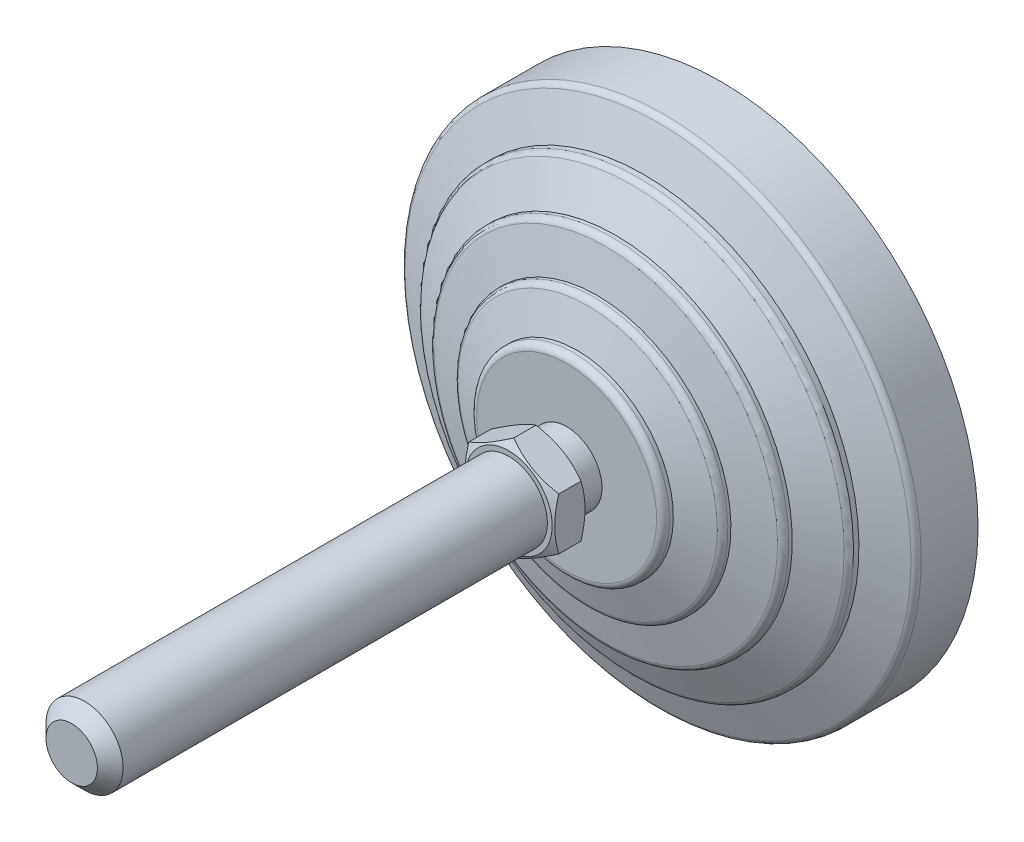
ISO-10303-21;
HEADER;
FILE_DESCRIPTION(('STEP AP214'),'2;1');
FILE_NAME('part.step','',(''),(''),'','','');
FILE_SCHEMA(('AUTOMOTIVE_DESIGN { 1 0 10303 214 1 1 1 1 }'));
ENDSEC;
DATA;
#1=APPLICATION_CONTEXT('core data for automotive mechanical design processes');
#2=APPLICATION_PROTOCOL_DEFINITION('international standard','automotive_design',2000,#1);
#3=PRODUCT_CONTEXT('',#1,'mechanical');
#4=PRODUCT('Part','Part','',(#3));
#5=PRODUCT_RELATED_PRODUCT_CATEGORY('part','',(#4));
#6=PRODUCT_DEFINITION_FORMATION('','',#4);
#7=PRODUCT_DEFINITION_CONTEXT('part definition',#1,'design');
#8=PRODUCT_DEFINITION('design','',#6,#7);
#9=PRODUCT_DEFINITION_SHAPE('','',#8);
#10=(LENGTH_UNIT() NAMED_UNIT(*) SI_UNIT(.MILLI.,.METRE.));
#11=(NAMED_UNIT(*) PLANE_ANGLE_UNIT() SI_UNIT($,.RADIAN.));
#12=(NAMED_UNIT(*) SI_UNIT($,.STERADIAN.) SOLID_ANGLE_UNIT());
#13=UNCERTAINTY_MEASURE_WITH_UNIT(LENGTH_MEASURE(1.E-05),#10,'distance_accuracy_value','');
#14=(GEOMETRIC_REPRESENTATION_CONTEXT(3) GLOBAL_UNCERTAINTY_ASSIGNED_CONTEXT((#13)) GLOBAL_UNIT_ASSIGNED_CONTEXT((#10,
#11,#12)) REPRESENTATION_CONTEXT('',''));
#15=CARTESIAN_POINT('',(0.,0.,0.));
#16=DIRECTION('',(0.,0.,1.));
#17=DIRECTION('',(1.,0.,0.));
#18=AXIS2_PLACEMENT_3D('',#15,#16,#17);
#19=CARTESIAN_POINT('',(-5.5000000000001,0.,28.));
#20=DIRECTION('',(0.,0.,1.));
#21=DIRECTION('',(0.,-1.,0.));
#22=AXIS2_PLACEMENT_3D('',#19,#20,#21);
#23=PLANE('',#22);
#24=CARTESIAN_POINT('',(0.,0.,28.));
#25=DIRECTION('',(0.,0.,-1.));
#26=DIRECTION('',(-1.,0.,0.));
#27=AXIS2_PLACEMENT_3D('',#24,#25,#26);
#28=CIRCLE('',#27,6.75);
#29=CARTESIAN_POINT('',(-6.75,0.,28.));
#30=VERTEX_POINT('',#29);
#31=EDGE_CURVE('E575',#30,#30,#28,.T.);
#32=ORIENTED_EDGE('',*,*,#31,.T.);
#33=EDGE_LOOP('',(#32));
#34=FACE_BOUND('',#33,.T.);
#35=CARTESIAN_POINT('',(0.,0.,28.));
#36=DIRECTION('',(0.,0.,-1.));
#37=DIRECTION('',(0.,1.,0.));
#38=AXIS2_PLACEMENT_3D('',#35,#36,#37);
#39=CIRCLE('',#38,5.5000000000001);
#40=CARTESIAN_POINT('',(0.,5.5000000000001,28.));
#41=VERTEX_POINT('',#40);
#42=EDGE_CURVE('E147',#41,#41,#39,.T.);
#43=ORIENTED_EDGE('',*,*,#42,.F.);
#44=EDGE_LOOP('',(#43));
#45=FACE_BOUND('',#44,.T.);
#46=ADVANCED_FACE('F14',(#34,#45),#23,.F.);
#47=CARTESIAN_POINT('',(0.,0.,0.));
#48=DIRECTION('',(0.,0.,-1.));
#49=DIRECTION('',(0.,1.,0.));
#50=AXIS2_PLACEMENT_3D('',#47,#48,#49);
#51=CYLINDRICAL_SURFACE('',#50,5.5000000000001);
#52=CARTESIAN_POINT('',(0.,0.,24.));
#53=DIRECTION('',(0.,0.,-1.));
#54=DIRECTION('',(0.,1.,0.));
#55=AXIS2_PLACEMENT_3D('',#52,#53,#54);
#56=CIRCLE('',#55,5.5000000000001);
#57=CARTESIAN_POINT('',(0.,5.5000000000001,24.));
#58=VERTEX_POINT('',#57);
#59=EDGE_CURVE('E144',#58,#58,#56,.T.);
#60=ORIENTED_EDGE('',*,*,#59,.F.);
#61=EDGE_LOOP('',(#60));
#62=FACE_BOUND('',#61,.T.);
#63=ORIENTED_EDGE('',*,*,#42,.T.);
#64=EDGE_LOOP('',(#63));
#65=FACE_BOUND('',#64,.T.);
#66=ADVANCED_FACE('F173',(#62,#65),#51,.T.);
#67=CARTESIAN_POINT('',(-5.5000000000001,0.,24.));
#68=DIRECTION('',(0.,0.,-1.));
#69=DIRECTION('',(0.,1.,0.));
#70=AXIS2_PLACEMENT_3D('',#67,#68,#69);
#71=PLANE('',#70);
#72=CARTESIAN_POINT('',(0.,0.,24.));
#73=DIRECTION('',(0.,0.,-1.));
#74=DIRECTION('',(0.,1.,0.));
#75=AXIS2_PLACEMENT_3D('',#72,#73,#74);
#76=CIRCLE('',#75,14.);
#77=CARTESIAN_POINT('',(0.,14.,24.));
#78=VERTEX_POINT('',#77);
#79=EDGE_CURVE('E141',#78,#78,#76,.T.);
#80=ORIENTED_EDGE('',*,*,#79,.F.);
#81=EDGE_LOOP('',(#80));
#82=FACE_BOUND('',#81,.T.);
#83=ORIENTED_EDGE('',*,*,#59,.T.);
#84=EDGE_LOOP('',(#83));
#85=FACE_BOUND('',#84,.T.);
#86=ADVANCED_FACE('F180',(#82,#85),#71,.F.);
#87=CARTESIAN_POINT('',(0.,0.,23.));
#88=DIRECTION('',(0.,0.,-1.));
#89=DIRECTION('',(0.,1.,0.));
#90=AXIS2_PLACEMENT_3D('',#87,#88,#89);
#91=TOROIDAL_SURFACE('',#90,14.,1.);
#92=CARTESIAN_POINT('',(0.,0.,23.));
#93=DIRECTION('',(0.,0.,-1.));
#94=DIRECTION('',(0.,1.,0.));
#95=AXIS2_PLACEMENT_3D('',#92,#93,#94);
#96=CIRCLE('',#95,15.);
#97=CARTESIAN_POINT('',(0.,15.,23.));
#98=VERTEX_POINT('',#97);
#99=EDGE_CURVE('E138',#98,#98,#96,.T.);
#100=ORIENTED_EDGE('',*,*,#99,.F.);
#101=EDGE_LOOP('',(#100));
#102=FACE_BOUND('',#101,.T.);
#103=ORIENTED_EDGE('',*,*,#79,.T.);
#104=EDGE_LOOP('',(#103));
#105=FACE_BOUND('',#104,.T.);
#106=ADVANCED_FACE('F407',(#102,#105),#91,.T.);
#107=CARTESIAN_POINT('',(0.,0.,0.));
#108=DIRECTION('',(0.,0.,-1.));
#109=DIRECTION('',(0.,1.,0.));
#110=AXIS2_PLACEMENT_3D('',#107,#108,#109);
#111=CYLINDRICAL_SURFACE('',#110,15.);
#112=CARTESIAN_POINT('',(0.,0.,22.4025287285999));
#113=DIRECTION('',(0.,0.,-1.));
#114=DIRECTION('',(0.,1.,0.));
#115=AXIS2_PLACEMENT_3D('',#112,#113,#114);
#116=CIRCLE('',#115,15.);
#117=CARTESIAN_POINT('',(0.,15.,22.4025287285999));
#118=VERTEX_POINT('',#117);
#119=EDGE_CURVE('E135',#118,#118,#116,.T.);
#120=ORIENTED_EDGE('',*,*,#119,.F.);
#121=EDGE_LOOP('',(#120));
#122=FACE_BOUND('',#121,.T.);
#123=ORIENTED_EDGE('',*,*,#99,.T.);
#124=EDGE_LOOP('',(#123));
#125=FACE_BOUND('',#124,.T.);
#126=ADVANCED_FACE('F397',(#122,#125),#111,.T.);
#127=CARTESIAN_POINT('',(0.,0.,22.4025287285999));
#128=DIRECTION('',(0.,0.,-1.));
#129=DIRECTION('',(0.,1.,0.));
#130=AXIS2_PLACEMENT_3D('',#127,#128,#129);
#131=CONICAL_SURFACE('',#130,15.,1.25589726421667);
#132=CARTESIAN_POINT('',(0.,0.,20.7216684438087));
#133=DIRECTION('',(0.,0.,-1.));
#134=DIRECTION('',(0.,1.,0.));
#135=AXIS2_PLACEMENT_3D('',#132,#133,#134);
#136=CIRCLE('',#135,20.16016354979);
#137=CARTESIAN_POINT('',(0.,20.16016354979,20.7216684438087));
#138=VERTEX_POINT('',#137);
#139=EDGE_CURVE('E132',#138,#138,#136,.T.);
#140=ORIENTED_EDGE('',*,*,#139,.F.);
#141=EDGE_LOOP('',(#140));
#142=FACE_BOUND('',#141,.T.);
#143=ORIENTED_EDGE('',*,*,#119,.T.);
#144=EDGE_LOOP('',(#143));
#145=FACE_BOUND('',#144,.T.);
#146=ADVANCED_FACE('F387',(#142,#145),#131,.T.);
#147=CARTESIAN_POINT('',(0.,0.,19.7708407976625));
#148=DIRECTION('',(0.,0.,-1.));
#149=DIRECTION('',(0.,1.,0.));
#150=AXIS2_PLACEMENT_3D('',#147,#148,#149);
#151=TOROIDAL_SURFACE('',#150,19.8504430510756,1.);
#152=CARTESIAN_POINT('',(0.,0.,19.7708407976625));
#153=DIRECTION('',(0.,0.,-1.));
#154=DIRECTION('',(0.,1.,0.));
#155=AXIS2_PLACEMENT_3D('',#152,#153,#154);
#156=CIRCLE('',#155,20.8504430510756);
#157=CARTESIAN_POINT('',(0.,20.8504430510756,19.7708407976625));
#158=VERTEX_POINT('',#157);
#159=EDGE_CURVE('E129',#158,#158,#156,.T.);
#160=ORIENTED_EDGE('',*,*,#159,.F.);
#161=EDGE_LOOP('',(#160));
#162=FACE_BOUND('',#161,.T.);
#163=ORIENTED_EDGE('',*,*,#139,.T.);
#164=EDGE_LOOP('',(#163));
#165=FACE_BOUND('',#164,.T.);
#166=ADVANCED_FACE('F377',(#162,#165),#151,.T.);
#167=CARTESIAN_POINT('',(0.,0.,0.));
#168=DIRECTION('',(0.,0.,-1.));
#169=DIRECTION('',(0.,1.,0.));
#170=AXIS2_PLACEMENT_3D('',#167,#168,#169);
#171=CYLINDRICAL_SURFACE('',#170,20.8504430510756);
#172=CARTESIAN_POINT('',(0.,0.,19.2987385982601));
#173=DIRECTION('',(0.,0.,-1.));
#174=DIRECTION('',(0.,1.,0.));
#175=AXIS2_PLACEMENT_3D('',#172,#173,#174);
#176=CIRCLE('',#175,20.8504430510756);
#177=CARTESIAN_POINT('',(0.,20.8504430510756,19.2987385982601));
#178=VERTEX_POINT('',#177);
#179=EDGE_CURVE('E126',#178,#178,#176,.T.);
#180=ORIENTED_EDGE('',*,*,#179,.F.);
#181=EDGE_LOOP('',(#180));
#182=FACE_BOUND('',#181,.T.);
#183=ORIENTED_EDGE('',*,*,#159,.T.);
#184=EDGE_LOOP('',(#183));
#185=FACE_BOUND('',#184,.T.);
#186=ADVANCED_FACE('F367',(#182,#185),#171,.T.);
#187=CARTESIAN_POINT('',(0.,0.,19.2987385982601));
#188=DIRECTION('',(0.,0.,-1.));
#189=DIRECTION('',(0.,1.,0.));
#190=AXIS2_PLACEMENT_3D('',#187,#188,#189);
#191=CONICAL_SURFACE('',#190,20.8504430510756,1.34067144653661);
#192=CARTESIAN_POINT('',(0.,0.,17.9217501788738));
#193=DIRECTION('',(0.,0.,-1.));
#194=DIRECTION('',(0.,1.,0.));
#195=AXIS2_PLACEMENT_3D('',#192,#193,#194);
#196=CIRCLE('',#195,26.7280991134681);
#197=CARTESIAN_POINT('',(0.,26.7280991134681,17.9217501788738));
#198=VERTEX_POINT('',#197);
#199=EDGE_CURVE('E123',#198,#198,#196,.T.);
#200=ORIENTED_EDGE('',*,*,#199,.F.);
#201=EDGE_LOOP('',(#200));
#202=FACE_BOUND('',#201,.T.);
#203=ORIENTED_EDGE('',*,*,#179,.T.);
#204=EDGE_LOOP('',(#203));
#205=FACE_BOUND('',#204,.T.);
#206=ADVANCED_FACE('F357',(#202,#205),#191,.T.);
#207=CARTESIAN_POINT('',(0.,0.,16.9481122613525));
#208=DIRECTION('',(0.,0.,-1.));
#209=DIRECTION('',(0.,1.,0.));
#210=AXIS2_PLACEMENT_3D('',#207,#208,#209);
#211=TOROIDAL_SURFACE('',#210,26.5,1.00000000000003);
#212=CARTESIAN_POINT('',(0.,0.,16.9481122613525));
#213=DIRECTION('',(0.,0.,-1.));
#214=DIRECTION('',(0.,1.,0.));
#215=AXIS2_PLACEMENT_3D('',#212,#213,#214);
#216=CIRCLE('',#215,27.5);
#217=CARTESIAN_POINT('',(0.,27.5,16.9481122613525));
#218=VERTEX_POINT('',#217);
#219=EDGE_CURVE('E120',#218,#218,#216,.T.);
#220=ORIENTED_EDGE('',*,*,#219,.F.);
#221=EDGE_LOOP('',(#220));
#222=FACE_BOUND('',#221,.T.);
#223=ORIENTED_EDGE('',*,*,#199,.T.);
#224=EDGE_LOOP('',(#223));
#225=FACE_BOUND('',#224,.T.);
#226=ADVANCED_FACE('F347',(#222,#225),#211,.T.);
#227=CARTESIAN_POINT('',(0.,0.,0.));
#228=DIRECTION('',(0.,0.,-1.));
#229=DIRECTION('',(0.,1.,0.));
#230=AXIS2_PLACEMENT_3D('',#227,#228,#229);
#231=CYLINDRICAL_SURFACE('',#230,27.5);
#232=CARTESIAN_POINT('',(0.,0.,16.4025287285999));
#233=DIRECTION('',(0.,0.,-1.));
#234=DIRECTION('',(0.,1.,0.));
#235=AXIS2_PLACEMENT_3D('',#232,#233,#234);
#236=CIRCLE('',#235,27.5);
#237=CARTESIAN_POINT('',(0.,27.5,16.4025287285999));
#238=VERTEX_POINT('',#237);
#239=EDGE_CURVE('E117',#238,#238,#236,.T.);
#240=ORIENTED_EDGE('',*,*,#239,.F.);
#241=EDGE_LOOP('',(#240));
#242=FACE_BOUND('',#241,.T.);
#243=ORIENTED_EDGE('',*,*,#219,.T.);
#244=EDGE_LOOP('',(#243));
#245=FACE_BOUND('',#244,.T.);
#246=ADVANCED_FACE('F337',(#242,#245),#231,.T.);
#247=CARTESIAN_POINT('',(0.,0.,16.4025287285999));
#248=DIRECTION('',(0.,0.,-1.));
#249=DIRECTION('',(0.,1.,0.));
#250=AXIS2_PLACEMENT_3D('',#247,#248,#249);
#251=CONICAL_SURFACE('',#250,27.5,1.1202291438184);
#252=CARTESIAN_POINT('',(0.,0.,13.7730910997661));
#253=DIRECTION('',(0.,0.,-1.));
#254=DIRECTION('',(0.,1.,0.));
#255=AXIS2_PLACEMENT_3D('',#252,#253,#254);
#256=CIRCLE('',#255,32.9354761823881);
#257=CARTESIAN_POINT('',(0.,32.9354761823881,13.7730910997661));
#258=VERTEX_POINT('',#257);
#259=EDGE_CURVE('E114',#258,#258,#256,.T.);
#260=ORIENTED_EDGE('',*,*,#259,.F.);
#261=EDGE_LOOP('',(#260));
#262=FACE_BOUND('',#261,.T.);
#263=ORIENTED_EDGE('',*,*,#239,.T.);
#264=EDGE_LOOP('',(#263));
#265=FACE_BOUND('',#264,.T.);
#266=ADVANCED_FACE('F327',(#262,#265),#251,.T.);
#267=CARTESIAN_POINT('',(0.,0.,12.8728908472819));
#268=DIRECTION('',(0.,0.,-1.));
#269=DIRECTION('',(0.,1.,0.));
#270=AXIS2_PLACEMENT_3D('',#267,#268,#269);
#271=TOROIDAL_SURFACE('',#270,32.5,0.999999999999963);
#272=CARTESIAN_POINT('',(0.,0.,12.8728908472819));
#273=DIRECTION('',(0.,0.,-1.));
#274=DIRECTION('',(0.,1.,0.));
#275=AXIS2_PLACEMENT_3D('',#272,#273,#274);
#276=CIRCLE('',#275,33.5);
#277=CARTESIAN_POINT('',(0.,33.5,12.8728908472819));
#278=VERTEX_POINT('',#277);
#279=EDGE_CURVE('E111',#278,#278,#276,.T.);
#280=ORIENTED_EDGE('',*,*,#279,.F.);
#281=EDGE_LOOP('',(#280));
#282=FACE_BOUND('',#281,.T.);
#283=ORIENTED_EDGE('',*,*,#259,.T.);
#284=EDGE_LOOP('',(#283));
#285=FACE_BOUND('',#284,.T.);
#286=ADVANCED_FACE('F317',(#282,#285),#271,.T.);
#287=CARTESIAN_POINT('',(0.,0.,0.));
#288=DIRECTION('',(0.,0.,-1.));
#289=DIRECTION('',(0.,1.,0.));
#290=AXIS2_PLACEMENT_3D('',#287,#288,#289);
#291=CYLINDRICAL_SURFACE('',#290,33.5);
#292=CARTESIAN_POINT('',(0.,0.,12.0315037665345));
#293=DIRECTION('',(0.,0.,-1.));
#294=DIRECTION('',(0.,1.,0.));
#295=AXIS2_PLACEMENT_3D('',#292,#293,#294);
#296=CIRCLE('',#295,33.5);
#297=CARTESIAN_POINT('',(0.,33.5,12.0315037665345));
#298=VERTEX_POINT('',#297);
#299=EDGE_CURVE('E108',#298,#298,#296,.T.);
#300=ORIENTED_EDGE('',*,*,#299,.F.);
#301=EDGE_LOOP('',(#300));
#302=FACE_BOUND('',#301,.T.);
#303=ORIENTED_EDGE('',*,*,#279,.T.);
#304=EDGE_LOOP('',(#303));
#305=FACE_BOUND('',#304,.T.);
#306=ADVANCED_FACE('F307',(#302,#305),#291,.T.);
#307=CARTESIAN_POINT('',(0.,0.,12.0315037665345));
#308=DIRECTION('',(0.,0.,-1.));
#309=DIRECTION('',(0.,1.,0.));
#310=AXIS2_PLACEMENT_3D('',#307,#308,#309);
#311=CONICAL_SURFACE('',#310,33.5,1.20362249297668);
#312=CARTESIAN_POINT('',(0.,0.,9.77805027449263));
#313=DIRECTION('',(0.,0.,-1.));
#314=DIRECTION('',(0.,1.,0.));
#315=AXIS2_PLACEMENT_3D('',#312,#313,#314);
#316=CIRCLE('',#315,39.3589790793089);
#317=CARTESIAN_POINT('',(0.,39.3589790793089,9.77805027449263));
#318=VERTEX_POINT('',#317);
#319=EDGE_CURVE('E105',#318,#318,#316,.T.);
#320=ORIENTED_EDGE('',*,*,#319,.F.);
#321=EDGE_LOOP('',(#320));
#322=FACE_BOUND('',#321,.T.);
#323=ORIENTED_EDGE('',*,*,#299,.T.);
#324=EDGE_LOOP('',(#323));
#325=FACE_BOUND('',#324,.T.);
#326=ADVANCED_FACE('F297',(#322,#325),#311,.T.);
#327=CARTESIAN_POINT('',(0.,0.,8.84470466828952));
#328=DIRECTION('',(0.,0.,-1.));
#329=DIRECTION('',(0.,1.,0.));
#330=AXIS2_PLACEMENT_3D('',#327,#328,#329);
#331=TOROIDAL_SURFACE('',#330,39.,1.00000000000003);
#332=CARTESIAN_POINT('',(0.,0.,8.84470466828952));
#333=DIRECTION('',(0.,0.,-1.));
#334=DIRECTION('',(0.,1.,0.));
#335=AXIS2_PLACEMENT_3D('',#332,#333,#334);
#336=CIRCLE('',#335,40.);
#337=CARTESIAN_POINT('',(0.,40.,8.84470466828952));
#338=VERTEX_POINT('',#337);
#339=EDGE_CURVE('E102',#338,#338,#336,.T.);
#340=ORIENTED_EDGE('',*,*,#339,.F.);
#341=EDGE_LOOP('',(#340));
#342=FACE_BOUND('',#341,.T.);
#343=ORIENTED_EDGE('',*,*,#319,.T.);
#344=EDGE_LOOP('',(#343));
#345=FACE_BOUND('',#344,.T.);
#346=ADVANCED_FACE('F287',(#342,#345),#331,.T.);
#347=CARTESIAN_POINT('',(0.,0.,0.));
#348=DIRECTION('',(0.,0.,-1.));
#349=DIRECTION('',(0.,1.,0.));
#350=AXIS2_PLACEMENT_3D('',#347,#348,#349);
#351=CYLINDRICAL_SURFACE('',#350,40.);
#352=CARTESIAN_POINT('',(0.,0.,0.));
#353=DIRECTION('',(0.,0.,-1.));
#354=DIRECTION('',(0.,1.,0.));
#355=AXIS2_PLACEMENT_3D('',#352,#353,#354);
#356=CIRCLE('',#355,40.);
#357=CARTESIAN_POINT('',(0.,40.,0.));
#358=VERTEX_POINT('',#357);
#359=EDGE_CURVE('E99',#358,#358,#356,.T.);
#360=ORIENTED_EDGE('',*,*,#359,.F.);
#361=EDGE_LOOP('',(#360));
#362=FACE_BOUND('',#361,.T.);
#363=ORIENTED_EDGE('',*,*,#339,.T.);
#364=EDGE_LOOP('',(#363));
#365=FACE_BOUND('',#364,.T.);
#366=ADVANCED_FACE('F277',(#362,#365),#351,.T.);
#367=CARTESIAN_POINT('',(0.,0.,0.));
#368=DIRECTION('',(0.,0.,1.));
#369=DIRECTION('',(0.,-1.,0.));
#370=AXIS2_PLACEMENT_3D('',#367,#368,#369);
#371=PLANE('',#370);
#372=ORIENTED_EDGE('',*,*,#359,.T.);
#373=EDGE_LOOP('',(#372));
#374=FACE_BOUND('',#373,.T.);
#375=ADVANCED_FACE('F169',(#374),#371,.F.);
#376=CARTESIAN_POINT('',(0.,0.,29.6477414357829));
#377=DIRECTION('',(0.,0.,1.));
#378=DIRECTION('',(1.,0.,0.));
#379=AXIS2_PLACEMENT_3D('',#376,#377,#378);
#380=CONICAL_SURFACE('',#379,9.60397188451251,1.0471975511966);
#381=CARTESIAN_POINT('',(0.000200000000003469,-8.0830192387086,28.7696190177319));
#382=CARTESIAN_POINT('',(-0.153667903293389,-7.99418356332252,28.7183374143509));
#383=CARTESIAN_POINT('',(-0.308109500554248,-7.90501666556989,28.669383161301));
#384=CARTESIAN_POINT('',(-0.618246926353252,-7.72595873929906,28.5767703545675));
#385=CARTESIAN_POINT('',(-0.773943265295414,-7.63606741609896,28.5331140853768));
#386=CARTESIAN_POINT('',(-1.24352516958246,-7.36495417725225,28.4109491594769));
#387=CARTESIAN_POINT('',(-1.5592643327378,-7.18266208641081,28.3414631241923));
#388=CARTESIAN_POINT('',(-2.03176224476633,-6.90986528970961,28.2599825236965));
#389=CARTESIAN_POINT('',(-2.18710922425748,-6.82017566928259,28.2367710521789));
#390=CARTESIAN_POINT('',(-2.49850511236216,-6.64039116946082,28.1978487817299));
#391=CARTESIAN_POINT('',(-2.65455395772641,-6.55029632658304,28.1821373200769));
#392=CARTESIAN_POINT('',(-2.96692267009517,-6.36995016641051,28.1586154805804));
#393=CARTESIAN_POINT('',(-3.12324202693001,-6.27969914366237,28.1507961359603));
#394=CARTESIAN_POINT('',(-3.43601650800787,-6.09911871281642,28.1432178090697));
#395=CARTESIAN_POINT('',(-3.59247162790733,-6.00878930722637,28.1434585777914));
#396=CARTESIAN_POINT('',(-4.02110687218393,-5.76131663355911,28.155197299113));
#397=CARTESIAN_POINT('',(-4.2931466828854,-5.60425437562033,28.1749033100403));
#398=CARTESIAN_POINT('',(-4.8354194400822,-5.29117305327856,28.2373910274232));
#399=CARTESIAN_POINT('',(-5.10565047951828,-5.13515508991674,28.2801940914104));
#400=CARTESIAN_POINT('',(-5.64901454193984,-4.82144370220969,28.3871892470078));
#401=CARTESIAN_POINT('',(-5.92207900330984,-4.6637898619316,28.4518346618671));
#402=CARTESIAN_POINT('',(-6.46413578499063,-4.35083323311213,28.5985536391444));
#403=CARTESIAN_POINT('',(-6.73313504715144,-4.19552643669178,28.680592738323));
#404=CARTESIAN_POINT('',(-7.0002,-4.04133641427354,28.7696190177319));
#405=B_SPLINE_CURVE_WITH_KNOTS('',3,(#381,#382,#383,#384,#385,#386,#387,#388,#389,#390,#391,
#392,#393,#394,#395,#396,#397,#398,#399,#400,#401,#402,#403,#404),.UNSPECIFIED.,.F.,.F.,(4,2,2,
2,2,2,2,2,2,2,2,4),(0.,0.554727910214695,1.10969417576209,2.2219327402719,2.76443041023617,
3.30688013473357,3.8487128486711,4.39052882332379,5.33376515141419,6.27787517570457,
7.2429241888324,8.20607866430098),.UNSPECIFIED.);
#406=CARTESIAN_POINT('',(0.,-8.08290376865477,28.7695523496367));
#407=VERTEX_POINT('',#406);
#408=CARTESIAN_POINT('',(-7.,-4.04145188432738,28.7695523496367));
#409=VERTEX_POINT('',#408);
#410=EDGE_CURVE('E73',#407,#409,#405,.T.);
#411=ORIENTED_EDGE('',*,*,#410,.T.);
#412=CARTESIAN_POINT('',(-7.,-10.8206478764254,31.5434595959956));
#413=CARTESIAN_POINT('',(-7.,-10.5152040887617,31.3954338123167));
#414=CARTESIAN_POINT('',(-7.,-10.2090553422,31.2488375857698));
#415=CARTESIAN_POINT('',(-7.,-9.59497288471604,30.9593089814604));
#416=CARTESIAN_POINT('',(-7.,-9.28703889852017,30.8163771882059));
#417=CARTESIAN_POINT('',(-7.,-8.66740741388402,30.5342555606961));
#418=CARTESIAN_POINT('',(-7.,-8.35569853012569,30.3950906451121));
#419=CARTESIAN_POINT('',(-7.,-7.72978922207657,30.1225031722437));
#420=CARTESIAN_POINT('',(-7.,-7.41558891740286,29.9890803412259));
#421=CARTESIAN_POINT('',(-7.,-6.77419386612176,29.7253817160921));
#422=CARTESIAN_POINT('',(-7.,-6.44690264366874,29.5953392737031));
#423=CARTESIAN_POINT('',(-7.,-5.78847893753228,29.3451819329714));
#424=CARTESIAN_POINT('',(-7.,-5.45734602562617,29.2250681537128));
#425=CARTESIAN_POINT('',(-7.,-4.79133935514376,28.9979475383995));
#426=CARTESIAN_POINT('',(-7.,-4.45647484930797,28.8909138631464));
#427=CARTESIAN_POINT('',(-7.,-3.78195479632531,28.693409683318));
#428=CARTESIAN_POINT('',(-7.,-3.44230080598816,28.6029339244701));
#429=CARTESIAN_POINT('',(-7.,-2.7598294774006,28.4433957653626));
#430=CARTESIAN_POINT('',(-7.,-2.41703970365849,28.3742186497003));
#431=CARTESIAN_POINT('',(-7.,-1.89976184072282,28.2894396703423));
#432=CARTESIAN_POINT('',(-7.,-1.72680738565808,28.2643433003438));
#433=CARTESIAN_POINT('',(-7.,-1.38005082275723,28.2209724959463));
#434=CARTESIAN_POINT('',(-7.,-1.20624879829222,28.2026974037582));
#435=CARTESIAN_POINT('',(-7.,-0.86028500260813,28.1735606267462));
#436=CARTESIAN_POINT('',(-7.,-0.688131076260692,28.1626061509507));
#437=CARTESIAN_POINT('',(-7.,-0.343514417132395,28.1479846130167));
#438=CARTESIAN_POINT('',(-7.,-0.171051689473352,28.1443174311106));
#439=CARTESIAN_POINT('',(-7.,0.173874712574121,28.1443578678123));
#440=CARTESIAN_POINT('',(-7.,0.346338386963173,28.1480655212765));
#441=CARTESIAN_POINT('',(-7.,0.690957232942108,28.1627656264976));
#442=CARTESIAN_POINT('',(-7.,0.863112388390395,28.1737584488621));
#443=CARTESIAN_POINT('',(-7.,1.27792539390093,28.2087916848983));
#444=CARTESIAN_POINT('',(-7.,1.5202924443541,28.2363481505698));
#445=CARTESIAN_POINT('',(-7.,2.00319310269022,28.3043887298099));
#446=CARTESIAN_POINT('',(-7.,2.24372645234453,28.3448746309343));
#447=CARTESIAN_POINT('',(-7.,2.96232032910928,28.4835767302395));
#448=CARTESIAN_POINT('',(-7.,3.43709947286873,28.5990110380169));
#449=CARTESIAN_POINT('',(-7.,4.14697628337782,28.7987501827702));
#450=CARTESIAN_POINT('',(-7.,4.38576692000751,28.8706812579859));
#451=CARTESIAN_POINT('',(-7.,4.86102813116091,29.0219062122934));
#452=CARTESIAN_POINT('',(-7.,5.09749869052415,29.1012001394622));
#453=CARTESIAN_POINT('',(-7.,5.56819624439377,29.2658875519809));
#454=CARTESIAN_POINT('',(-7.,5.80242397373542,29.3512789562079));
#455=CARTESIAN_POINT('',(-7.,6.2689460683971,29.5271674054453));
#456=CARTESIAN_POINT('',(-7.,6.50124045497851,29.6176643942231));
#457=CARTESIAN_POINT('',(-7.,7.04378696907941,29.8348018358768));
#458=CARTESIAN_POINT('',(-7.,7.35334994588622,29.9631609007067));
#459=CARTESIAN_POINT('',(-7.,7.96989286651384,30.2259568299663));
#460=CARTESIAN_POINT('',(-7.,8.27687266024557,30.3603940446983));
#461=CARTESIAN_POINT('',(-7.,8.88871693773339,30.634141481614));
#462=CARTESIAN_POINT('',(-7.,9.19358100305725,30.7734526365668));
#463=CARTESIAN_POINT('',(-7.,9.80149480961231,31.0559856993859));
#464=CARTESIAN_POINT('',(-7.,10.1045445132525,31.1992076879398));
#465=CARTESIAN_POINT('',(-7.,10.7094285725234,31.4889837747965));
#466=CARTESIAN_POINT('',(-7.,11.0112613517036,31.6355411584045));
#467=CARTESIAN_POINT('',(-7.,11.6136371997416,31.931285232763));
#468=CARTESIAN_POINT('',(-7.,11.9141802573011,32.0804719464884));
#469=CARTESIAN_POINT('',(-7.,12.8141030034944,32.5312467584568));
#470=CARTESIAN_POINT('',(-7.,13.4118535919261,32.836086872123));
#471=CARTESIAN_POINT('',(-7.,14.5551158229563,33.4265468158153));
#472=CARTESIAN_POINT('',(-7.,15.100877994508,33.711683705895));
#473=CARTESIAN_POINT('',(-7.,16.1903700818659,34.2858553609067));
#474=CARTESIAN_POINT('',(-7.,16.7340999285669,34.5748902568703));
#475=CARTESIAN_POINT('',(-7.,17.8186594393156,35.155233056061));
#476=CARTESIAN_POINT('',(-7.,18.3594929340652,35.4465338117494));
#477=CARTESIAN_POINT('',(-7.,19.4398572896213,36.031473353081));
#478=CARTESIAN_POINT('',(-7.,19.9793882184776,36.325112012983));
#479=CARTESIAN_POINT('',(-7.,20.5184381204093,36.6196251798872));
#480=B_SPLINE_CURVE_WITH_KNOTS('',3,(#412,#413,#414,#415,#416,#417,#418,#419,#420,#421,#422,
#423,#424,#425,#426,#427,#428,#429,#430,#431,#432,#433,#434,#435,#436,#437,#438,#439,#440,#441,
#442,#443,#444,#445,#446,#447,#448,#449,#450,#451,#452,#453,#454,#455,#456,#457,#458,#459,#460,
#461,#462,#463,#464,#465,#466,#467,#468,#469,#470,#471,#472,#473,#474,#475,#476,#477,#478,#479),
.UNSPECIFIED.,.F.,.F.,(4,2,2,2,2,2,2,2,2,2,2,2,2,2,2,2,2,2,2,2,2,2,2,2,2,2,2,2,2,2,2,2,2,4),(0.,
1.01827969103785,2.03672080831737,3.06076607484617,4.08476246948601,5.14117677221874,
6.19770998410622,7.25203752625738,8.30602991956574,9.35424193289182,9.87842584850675,
10.4025592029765,10.9199161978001,11.4372646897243,11.9546156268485,12.4719928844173,
13.2033645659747,13.9348374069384,15.3986087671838,16.1467157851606,16.8948276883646,
17.6426854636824,18.3905350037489,19.3958075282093,20.4011380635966,21.4066620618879,
22.4122068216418,23.4187890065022,24.425379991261,26.4383043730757,28.2855651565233,
30.132888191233,31.9757637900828,33.8185409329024),.UNSPECIFIED.);
#481=CARTESIAN_POINT('',(-7.,4.04145188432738,28.7695523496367));
#482=VERTEX_POINT('',#481);
#483=EDGE_CURVE('E81',#409,#482,#480,.T.);
#484=ORIENTED_EDGE('',*,*,#483,.T.);
#485=CARTESIAN_POINT('',(-7.0002,4.04133641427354,28.7696190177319));
#486=CARTESIAN_POINT('',(-6.84633209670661,4.13017208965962,28.7183374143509));
#487=CARTESIAN_POINT('',(-6.69189049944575,4.21933898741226,28.669383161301));
#488=CARTESIAN_POINT('',(-6.38175307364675,4.39839691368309,28.5767703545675));
#489=CARTESIAN_POINT('',(-6.22605673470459,4.48828823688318,28.5331140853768));
#490=CARTESIAN_POINT('',(-5.75647483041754,4.75940147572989,28.4109491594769));
#491=CARTESIAN_POINT('',(-5.4407356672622,4.94169356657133,28.3414631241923));
#492=CARTESIAN_POINT('',(-4.96823775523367,5.21449036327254,28.2599825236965));
#493=CARTESIAN_POINT('',(-4.81289077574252,5.30417998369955,28.2367710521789));
#494=CARTESIAN_POINT('',(-4.50149488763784,5.48396448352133,28.1978487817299));
#495=CARTESIAN_POINT('',(-4.3454460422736,5.57405932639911,28.1821373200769));
#496=CARTESIAN_POINT('',(-4.03307732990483,5.75440548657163,28.1586154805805));
#497=CARTESIAN_POINT('',(-3.87675797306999,5.84465650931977,28.1507961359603));
#498=CARTESIAN_POINT('',(-3.56398349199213,6.02523694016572,28.1432178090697));
#499=CARTESIAN_POINT('',(-3.40752837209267,6.11556634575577,28.1434585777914));
#500=CARTESIAN_POINT('',(-2.97889312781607,6.36303901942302,28.155197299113));
#501=CARTESIAN_POINT('',(-2.7068533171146,6.52010127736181,28.1749033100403));
#502=CARTESIAN_POINT('',(-2.1645805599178,6.83318259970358,28.2373910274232));
#503=CARTESIAN_POINT('',(-1.89434952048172,6.9892005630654,28.2801940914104));
#504=CARTESIAN_POINT('',(-1.35098545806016,7.30291195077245,28.3871892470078));
#505=CARTESIAN_POINT('',(-1.07792099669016,7.46056579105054,28.4518346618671));
#506=CARTESIAN_POINT('',(-0.535864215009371,7.77352241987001,28.5985536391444));
#507=CARTESIAN_POINT('',(-0.266864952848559,7.92882921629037,28.680592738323));
#508=CARTESIAN_POINT('',(0.000199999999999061,8.0830192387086,28.7696190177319));
#509=B_SPLINE_CURVE_WITH_KNOTS('',3,(#485,#486,#487,#488,#489,#490,#491,#492,#493,#494,#495,
#496,#497,#498,#499,#500,#501,#502,#503,#504,#505,#506,#507,#508),.UNSPECIFIED.,.F.,.F.,(4,2,2,
2,2,2,2,2,2,2,2,4),(0.,0.554727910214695,1.10969417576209,2.2219327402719,2.76443041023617,
3.30688013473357,3.8487128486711,4.39052882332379,5.33376515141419,6.27787517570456,
7.2429241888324,8.20607866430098),.UNSPECIFIED.);
#510=CARTESIAN_POINT('',(0.,8.08290376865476,28.7695523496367));
#511=VERTEX_POINT('',#510);
#512=EDGE_CURVE('E530',#482,#511,#509,.T.);
#513=ORIENTED_EDGE('',*,*,#512,.T.);
#514=CARTESIAN_POINT('',(-0.000200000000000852,8.0830192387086,28.7696190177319));
#515=CARTESIAN_POINT('',(0.153667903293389,7.99418356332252,28.7183374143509));
#516=CARTESIAN_POINT('',(0.308109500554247,7.90501666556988,28.669383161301));
#517=CARTESIAN_POINT('',(0.618246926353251,7.72595873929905,28.5767703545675));
#518=CARTESIAN_POINT('',(0.773943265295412,7.63606741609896,28.5331140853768));
#519=CARTESIAN_POINT('',(1.24352516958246,7.36495417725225,28.4109491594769));
#520=CARTESIAN_POINT('',(1.5592643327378,7.18266208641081,28.3414631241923));
#521=CARTESIAN_POINT('',(2.03176224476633,6.9098652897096,28.2599825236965));
#522=CARTESIAN_POINT('',(2.18710922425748,6.82017566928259,28.2367710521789));
#523=CARTESIAN_POINT('',(2.49850511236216,6.64039116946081,28.1978487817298));
#524=CARTESIAN_POINT('',(2.6545539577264,6.55029632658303,28.1821373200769));
#525=CARTESIAN_POINT('',(2.96692267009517,6.36995016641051,28.1586154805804));
#526=CARTESIAN_POINT('',(3.12324202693,6.27969914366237,28.1507961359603));
#527=CARTESIAN_POINT('',(3.43601650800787,6.09911871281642,28.1432178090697));
#528=CARTESIAN_POINT('',(3.59247162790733,6.00878930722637,28.1434585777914));
#529=CARTESIAN_POINT('',(4.02110687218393,5.76131663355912,28.155197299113));
#530=CARTESIAN_POINT('',(4.2931466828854,5.60425437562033,28.1749033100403));
#531=CARTESIAN_POINT('',(4.8354194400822,5.29117305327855,28.2373910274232));
#532=CARTESIAN_POINT('',(5.10565047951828,5.13515508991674,28.2801940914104));
#533=CARTESIAN_POINT('',(5.64901454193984,4.82144370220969,28.3871892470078));
#534=CARTESIAN_POINT('',(5.92207900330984,4.66378986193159,28.4518346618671));
#535=CARTESIAN_POINT('',(6.46413578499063,4.35083323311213,28.5985536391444));
#536=CARTESIAN_POINT('',(6.73313504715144,4.19552643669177,28.680592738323));
#537=CARTESIAN_POINT('',(7.0002,4.04133641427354,28.7696190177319));
#538=B_SPLINE_CURVE_WITH_KNOTS('',3,(#514,#515,#516,#517,#518,#519,#520,#521,#522,#523,#524,
#525,#526,#527,#528,#529,#530,#531,#532,#533,#534,#535,#536,#537),.UNSPECIFIED.,.F.,.F.,(4,2,2,
2,2,2,2,2,2,2,2,4),(0.,0.554727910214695,1.10969417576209,2.2219327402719,2.76443041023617,
3.30688013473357,3.8487128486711,4.39052882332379,5.33376515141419,6.27787517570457,
7.2429241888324,8.20607866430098),.UNSPECIFIED.);
#539=CARTESIAN_POINT('',(7.,4.04145188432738,28.7695523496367));
#540=VERTEX_POINT('',#539);
#541=EDGE_CURVE('E525',#511,#540,#538,.T.);
#542=ORIENTED_EDGE('',*,*,#541,.T.);
#543=CARTESIAN_POINT('',(7.,-10.820647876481,31.5434595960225));
#544=CARTESIAN_POINT('',(7.,-10.5152040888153,31.3954338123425));
#545=CARTESIAN_POINT('',(7.,-10.2090553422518,31.2488375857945));
#546=CARTESIAN_POINT('',(7.,-9.59497288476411,30.9593089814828));
#547=CARTESIAN_POINT('',(7.,-9.28703889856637,30.8163771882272));
#548=CARTESIAN_POINT('',(7.,-8.66740741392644,30.5342555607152));
#549=CARTESIAN_POINT('',(7.,-8.35569853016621,30.39509064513));
#550=CARTESIAN_POINT('',(7.,-7.72978922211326,30.1225031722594));
#551=CARTESIAN_POINT('',(7.,-7.41558891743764,29.9890803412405));
#552=CARTESIAN_POINT('',(7.,-6.77419386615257,29.7253817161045));
#553=CARTESIAN_POINT('',(7.,-6.4469026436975,29.5953392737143));
#554=CARTESIAN_POINT('',(7.,-5.78847893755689,29.3451819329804));
#555=CARTESIAN_POINT('',(7.,-5.45734602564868,29.2250681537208));
#556=CARTESIAN_POINT('',(7.,-4.79133935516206,28.9979475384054));
#557=CARTESIAN_POINT('',(7.,-4.45647484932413,28.8909138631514));
#558=CARTESIAN_POINT('',(7.,-3.78195479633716,28.6934096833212));
#559=CARTESIAN_POINT('',(7.,-3.44230080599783,28.6029339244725));
#560=CARTESIAN_POINT('',(7.,-2.75982947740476,28.4433957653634));
#561=CARTESIAN_POINT('',(7.,-2.41703970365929,28.3742186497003));
#562=CARTESIAN_POINT('',(7.,-1.89976184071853,28.2894396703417));
#563=CARTESIAN_POINT('',(7.,-1.72680738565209,28.2643433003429));
#564=CARTESIAN_POINT('',(7.,-1.38005082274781,28.2209724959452));
#565=CARTESIAN_POINT('',(7.,-1.20624879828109,28.2026974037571));
#566=CARTESIAN_POINT('',(7.,-0.860285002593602,28.1735606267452));
#567=CARTESIAN_POINT('',(7.,-0.688131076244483,28.1626061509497));
#568=CARTESIAN_POINT('',(7.,-0.343514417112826,28.1479846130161));
#569=CARTESIAN_POINT('',(7.,-0.171051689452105,28.1443174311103));
#570=CARTESIAN_POINT('',(7.,0.173874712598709,28.1443578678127));
#571=CARTESIAN_POINT('',(7.,0.346338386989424,28.1480655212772));
#572=CARTESIAN_POINT('',(7.,0.690957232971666,28.1627656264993));
#573=CARTESIAN_POINT('',(7.,0.863112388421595,28.1737584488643));
#574=CARTESIAN_POINT('',(7.,1.27792539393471,28.2087916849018));
#575=CARTESIAN_POINT('',(7.,1.52029244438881,28.236348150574));
#576=CARTESIAN_POINT('',(7.,2.00319310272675,28.3043887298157));
#577=CARTESIAN_POINT('',(7.,2.24372645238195,28.3448746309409));
#578=CARTESIAN_POINT('',(7.,2.96232032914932,28.4835767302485));
#579=CARTESIAN_POINT('',(7.,3.43709947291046,28.5990110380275));
#580=CARTESIAN_POINT('',(7.,4.14697628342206,28.7987501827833));
#581=CARTESIAN_POINT('',(7.,4.38576692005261,28.8706812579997));
#582=CARTESIAN_POINT('',(7.,4.86102813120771,29.0219062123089));
#583=CARTESIAN_POINT('',(7.,5.0974986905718,29.1012001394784));
#584=CARTESIAN_POINT('',(7.,5.56819624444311,29.2658875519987));
#585=CARTESIAN_POINT('',(7.,5.8024239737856,29.3512789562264));
#586=CARTESIAN_POINT('',(7.,6.26894606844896,29.5271674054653));
#587=CARTESIAN_POINT('',(7.,6.50124045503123,29.6176643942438));
#588=CARTESIAN_POINT('',(7.,7.04378696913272,29.8348018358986));
#589=CARTESIAN_POINT('',(7.,7.35334994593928,29.9631609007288));
#590=CARTESIAN_POINT('',(7.,7.96989286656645,30.2259568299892));
#591=CARTESIAN_POINT('',(7.,8.27687266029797,30.3603940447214));
#592=CARTESIAN_POINT('',(7.,8.88871693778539,30.6341414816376));
#593=CARTESIAN_POINT('',(7.,9.19358100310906,30.7734526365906));
#594=CARTESIAN_POINT('',(7.,9.80149480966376,31.0559856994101));
#595=CARTESIAN_POINT('',(7.,10.1045445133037,31.1992076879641));
#596=CARTESIAN_POINT('',(7.,10.7094285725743,31.4889837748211));
#597=CARTESIAN_POINT('',(7.,11.0112613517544,31.6355411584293));
#598=CARTESIAN_POINT('',(7.,11.613637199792,31.9312852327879));
#599=CARTESIAN_POINT('',(7.,11.9141802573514,32.0804719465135));
#600=CARTESIAN_POINT('',(7.,12.8141030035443,32.5312467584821));
#601=CARTESIAN_POINT('',(7.,13.4118535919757,32.8360868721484));
#602=CARTESIAN_POINT('',(7.,14.5551158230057,33.426546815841));
#603=CARTESIAN_POINT('',(7.,15.1008779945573,33.7116837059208));
#604=CARTESIAN_POINT('',(7.,16.1903700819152,34.2858553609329));
#605=CARTESIAN_POINT('',(7.,16.7340999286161,34.5748902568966));
#606=CARTESIAN_POINT('',(7.,17.8186594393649,35.1552330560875));
#607=CARTESIAN_POINT('',(7.,18.3594929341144,35.446533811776));
#608=CARTESIAN_POINT('',(7.,19.4398572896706,36.0314733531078));
#609=CARTESIAN_POINT('',(7.,19.979388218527,36.3251120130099));
#610=CARTESIAN_POINT('',(7.,20.5184381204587,36.6196251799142));
#611=B_SPLINE_CURVE_WITH_KNOTS('',3,(#543,#544,#545,#546,#547,#548,#549,#550,#551,#552,#553,
#554,#555,#556,#557,#558,#559,#560,#561,#562,#563,#564,#565,#566,#567,#568,#569,#570,#571,#572,
#573,#574,#575,#576,#577,#578,#579,#580,#581,#582,#583,#584,#585,#586,#587,#588,#589,#590,#591,
#592,#593,#594,#595,#596,#597,#598,#599,#600,#601,#602,#603,#604,#605,#606,#607,#608,#609,#610),
.UNSPECIFIED.,.F.,.F.,(4,2,2,2,2,2,2,2,2,2,2,2,2,2,2,2,2,2,2,2,2,2,2,2,2,2,2,2,2,2,2,2,2,4),(0.,
1.01827969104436,2.0367208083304,3.06076607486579,4.08476246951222,5.14117677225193,
6.1977099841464,7.25203752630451,8.30602991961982,9.35424193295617,9.87842584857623,
10.4025592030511,10.9199161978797,11.437264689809,11.9546156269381,12.471992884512,
13.2033645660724,13.9348374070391,15.3986087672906,16.1467157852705,16.8948276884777,
17.6426854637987,18.3905350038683,19.3958075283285,20.4011380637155,21.4066620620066,
22.4122068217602,23.4187890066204,24.4253799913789,26.4383043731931,28.2855651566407,
30.1328881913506,31.9757637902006,33.8185409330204),.UNSPECIFIED.);
#612=CARTESIAN_POINT('',(7.,-4.04145188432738,28.7695523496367));
#613=VERTEX_POINT('',#612);
#614=EDGE_CURVE('E34',#540,#613,#611,.F.);
#615=ORIENTED_EDGE('',*,*,#614,.T.);
#616=CARTESIAN_POINT('',(7.0002,-4.04133641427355,28.7696190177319));
#617=CARTESIAN_POINT('',(6.84633209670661,-4.13017208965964,28.7183374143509));
#618=CARTESIAN_POINT('',(6.69189049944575,-4.21933898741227,28.669383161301));
#619=CARTESIAN_POINT('',(6.38175307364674,-4.3983969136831,28.5767703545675));
#620=CARTESIAN_POINT('',(6.22605673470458,-4.4882882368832,28.5331140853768));
#621=CARTESIAN_POINT('',(5.75647483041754,-4.7594014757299,28.4109491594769));
#622=CARTESIAN_POINT('',(5.4407356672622,-4.94169356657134,28.3414631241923));
#623=CARTESIAN_POINT('',(4.96823775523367,-5.21449036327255,28.2599825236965));
#624=CARTESIAN_POINT('',(4.81289077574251,-5.30417998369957,28.2367710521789));
#625=CARTESIAN_POINT('',(4.50149488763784,-5.48396448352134,28.1978487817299));
#626=CARTESIAN_POINT('',(4.34544604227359,-5.57405932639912,28.1821373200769));
#627=CARTESIAN_POINT('',(4.03307732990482,-5.75440548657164,28.1586154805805));
#628=CARTESIAN_POINT('',(3.87675797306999,-5.84465650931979,28.1507961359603));
#629=CARTESIAN_POINT('',(3.56398349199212,-6.02523694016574,28.1432178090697));
#630=CARTESIAN_POINT('',(3.40752837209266,-6.11556634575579,28.1434585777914));
#631=CARTESIAN_POINT('',(2.97889312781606,-6.36303901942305,28.155197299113));
#632=CARTESIAN_POINT('',(2.7068533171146,-6.52010127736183,28.1749033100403));
#633=CARTESIAN_POINT('',(2.1645805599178,-6.8331825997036,28.2373910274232));
#634=CARTESIAN_POINT('',(1.89434952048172,-6.98920056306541,28.2801940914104));
#635=CARTESIAN_POINT('',(1.35098545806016,-7.30291195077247,28.3871892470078));
#636=CARTESIAN_POINT('',(1.07792099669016,-7.46056579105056,28.4518346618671));
#637=CARTESIAN_POINT('',(0.535864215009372,-7.77352241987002,28.5985536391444));
#638=CARTESIAN_POINT('',(0.266864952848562,-7.92882921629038,28.680592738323));
#639=CARTESIAN_POINT('',(-0.000199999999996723,-8.08301923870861,28.7696190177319));
#640=B_SPLINE_CURVE_WITH_KNOTS('',3,(#616,#617,#618,#619,#620,#621,#622,#623,#624,#625,#626,
#627,#628,#629,#630,#631,#632,#633,#634,#635,#636,#637,#638,#639),.UNSPECIFIED.,.F.,.F.,(4,2,2,
2,2,2,2,2,2,2,2,4),(0.,0.554727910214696,1.10969417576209,2.2219327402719,2.76443041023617,
3.30688013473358,3.8487128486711,4.39052882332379,5.33376515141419,6.27787517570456,
7.2429241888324,8.20607866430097),.UNSPECIFIED.);
#641=EDGE_CURVE('E9',#613,#407,#640,.T.);
#642=ORIENTED_EDGE('',*,*,#641,.T.);
#643=EDGE_LOOP('',(#411,#484,#513,#542,#615,#642));
#644=FACE_BOUND('',#643,.T.);
#645=ORIENTED_EDGE('',*,*,#31,.F.);
#646=EDGE_LOOP('',(#645));
#647=FACE_BOUND('',#646,.T.);
#648=ADVANCED_FACE('F71',(#644,#647),#380,.T.);
#649=CARTESIAN_POINT('',(-4.,0.,101.));
#650=DIRECTION('',(0.,0.,-1.));
#651=DIRECTION('',(0.,1.,0.));
#652=AXIS2_PLACEMENT_3D('',#649,#650,#651);
#653=PLANE('',#652);
#654=CARTESIAN_POINT('',(0.,0.,101.));
#655=DIRECTION('',(0.,0.,-1.));
#656=DIRECTION('',(0.,1.,0.));
#657=AXIS2_PLACEMENT_3D('',#654,#655,#656);
#658=CIRCLE('',#657,4.);
#659=CARTESIAN_POINT('',(0.,4.,101.));
#660=VERTEX_POINT('',#659);
#661=EDGE_CURVE('E96',#660,#660,#658,.T.);
#662=ORIENTED_EDGE('',*,*,#661,.F.);
#663=EDGE_LOOP('',(#662));
#664=FACE_BOUND('',#663,.T.);
#665=ADVANCED_FACE('F159',(#664),#653,.F.);
#666=CARTESIAN_POINT('',(0.,0.,101.));
#667=DIRECTION('',(0.,0.,-1.));
#668=DIRECTION('',(0.,1.,0.));
#669=AXIS2_PLACEMENT_3D('',#666,#667,#668);
#670=CONICAL_SURFACE('',#669,4.,0.78539816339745);
#671=CARTESIAN_POINT('',(0.,0.,99.));
#672=DIRECTION('',(0.,0.,-1.));
#673=DIRECTION('',(0.,1.,0.));
#674=AXIS2_PLACEMENT_3D('',#671,#672,#673);
#675=CIRCLE('',#674,6.);
#676=CARTESIAN_POINT('',(0.,6.,99.));
#677=VERTEX_POINT('',#676);
#678=EDGE_CURVE('E28',#677,#677,#675,.T.);
#679=ORIENTED_EDGE('',*,*,#678,.F.);
#680=EDGE_LOOP('',(#679));
#681=FACE_BOUND('',#680,.T.);
#682=ORIENTED_EDGE('',*,*,#661,.T.);
#683=EDGE_LOOP('',(#682));
#684=FACE_BOUND('',#683,.T.);
#685=ADVANCED_FACE('F16',(#681,#684),#670,.T.);
#686=CARTESIAN_POINT('',(0.,0.,0.));
#687=DIRECTION('',(0.,0.,-1.));
#688=DIRECTION('',(0.,1.,0.));
#689=AXIS2_PLACEMENT_3D('',#686,#687,#688);
#690=CYLINDRICAL_SURFACE('',#689,6.);
#691=CARTESIAN_POINT('',(0.,0.,33.));
#692=DIRECTION('',(0.,0.,-1.));
#693=DIRECTION('',(0.,1.,0.));
#694=AXIS2_PLACEMENT_3D('',#691,#692,#693);
#695=CIRCLE('',#694,6.);
#696=CARTESIAN_POINT('',(0.,6.,33.));
#697=VERTEX_POINT('',#696);
#698=EDGE_CURVE('E150',#697,#697,#695,.T.);
#699=ORIENTED_EDGE('',*,*,#698,.F.);
#700=EDGE_LOOP('',(#699));
#701=FACE_BOUND('',#700,.T.);
#702=ORIENTED_EDGE('',*,*,#678,.T.);
#703=EDGE_LOOP('',(#702));
#704=FACE_BOUND('',#703,.T.);
#705=ADVANCED_FACE('F155',(#701,#704),#690,.T.);
#706=CARTESIAN_POINT('',(-6.,0.,33.));
#707=DIRECTION('',(0.,0.,-1.));
#708=DIRECTION('',(0.,1.,0.));
#709=AXIS2_PLACEMENT_3D('',#706,#707,#708);
#710=PLANE('',#709);
#711=CARTESIAN_POINT('',(0.,0.,33.));
#712=DIRECTION('',(0.,0.,-1.));
#713=DIRECTION('',(-1.,0.,0.));
#714=AXIS2_PLACEMENT_3D('',#711,#712,#713);
#715=CIRCLE('',#714,6.75);
#716=CARTESIAN_POINT('',(-6.75,0.,33.));
#717=VERTEX_POINT('',#716);
#718=EDGE_CURVE('E80',#717,#717,#715,.T.);
#719=ORIENTED_EDGE('',*,*,#718,.F.);
#720=EDGE_LOOP('',(#719));
#721=FACE_BOUND('',#720,.T.);
#722=ORIENTED_EDGE('',*,*,#698,.T.);
#723=EDGE_LOOP('',(#722));
#724=FACE_BOUND('',#723,.T.);
#725=ADVANCED_FACE('F187',(#721,#724),#710,.F.);
#726=CARTESIAN_POINT('',(0.,0.,33.));
#727=DIRECTION('',(0.,0.,-1.));
#728=DIRECTION('',(-1.,0.,0.));
#729=AXIS2_PLACEMENT_3D('',#726,#727,#728);
#730=CONICAL_SURFACE('',#729,6.75,1.0471975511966);
#731=CARTESIAN_POINT('',(-7.0002,-4.04133641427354,32.2303809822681));
#732=CARTESIAN_POINT('',(-6.84633209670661,-4.13017208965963,32.2816625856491));
#733=CARTESIAN_POINT('',(-6.69189049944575,-4.21933898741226,32.330616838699));
#734=CARTESIAN_POINT('',(-6.38175307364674,-4.3983969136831,32.4232296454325));
#735=CARTESIAN_POINT('',(-6.22605673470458,-4.48828823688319,32.4668859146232));
#736=CARTESIAN_POINT('',(-5.75647483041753,-4.7594014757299,32.5890508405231));
#737=CARTESIAN_POINT('',(-5.4407356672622,-4.94169356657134,32.6585368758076));
#738=CARTESIAN_POINT('',(-4.96823775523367,-5.21449036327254,32.7400174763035));
#739=CARTESIAN_POINT('',(-4.81289077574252,-5.30417998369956,32.7632289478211));
#740=CARTESIAN_POINT('',(-4.50149488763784,-5.48396448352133,32.8021512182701));
#741=CARTESIAN_POINT('',(-4.34544604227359,-5.57405932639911,32.8178626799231));
#742=CARTESIAN_POINT('',(-4.03307732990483,-5.75440548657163,32.8413845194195));
#743=CARTESIAN_POINT('',(-3.87675797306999,-5.84465650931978,32.8492038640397));
#744=CARTESIAN_POINT('',(-3.56398349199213,-6.02523694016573,32.8567821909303));
#745=CARTESIAN_POINT('',(-3.40752837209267,-6.11556634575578,32.8565414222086));
#746=CARTESIAN_POINT('',(-2.97889312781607,-6.36303901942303,32.844802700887));
#747=CARTESIAN_POINT('',(-2.7068533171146,-6.52010127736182,32.8250966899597));
#748=CARTESIAN_POINT('',(-2.1645805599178,-6.83318259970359,32.7626089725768));
#749=CARTESIAN_POINT('',(-1.89434952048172,-6.98920056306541,32.7198059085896));
#750=CARTESIAN_POINT('',(-1.35098545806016,-7.30291195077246,32.6128107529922));
#751=CARTESIAN_POINT('',(-1.07792099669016,-7.46056579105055,32.5481653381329));
#752=CARTESIAN_POINT('',(-0.535864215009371,-7.77352241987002,32.4014463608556));
#753=CARTESIAN_POINT('',(-0.26686495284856,-7.92882921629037,32.319407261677));
#754=CARTESIAN_POINT('',(0.000200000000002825,-8.0830192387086,32.2303809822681));
#755=B_SPLINE_CURVE_WITH_KNOTS('',3,(#731,#732,#733,#734,#735,#736,#737,#738,#739,#740,#741,
#742,#743,#744,#745,#746,#747,#748,#749,#750,#751,#752,#753,#754),.UNSPECIFIED.,.F.,.F.,(4,2,2,
2,2,2,2,2,2,2,2,4),(0.,0.554727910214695,1.10969417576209,2.2219327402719,2.76443041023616,
3.30688013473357,3.8487128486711,4.39052882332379,5.33376515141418,6.27787517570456,
7.2429241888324,8.20607866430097),.UNSPECIFIED.);
#756=CARTESIAN_POINT('',(-7.,-4.04145188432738,32.2304476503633));
#757=VERTEX_POINT('',#756);
#758=CARTESIAN_POINT('',(0.,-8.08290376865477,32.2304476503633));
#759=VERTEX_POINT('',#758);
#760=EDGE_CURVE('E88',#757,#759,#755,.T.);
#761=ORIENTED_EDGE('',*,*,#760,.T.);
#762=CARTESIAN_POINT('',(-0.00019999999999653,-8.08301923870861,32.2303809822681));
#763=CARTESIAN_POINT('',(0.153667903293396,-7.99418356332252,32.2816625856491));
#764=CARTESIAN_POINT('',(0.308109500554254,-7.90501666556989,32.330616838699));
#765=CARTESIAN_POINT('',(0.618246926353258,-7.72595873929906,32.4232296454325));
#766=CARTESIAN_POINT('',(0.773943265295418,-7.63606741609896,32.4668859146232));
#767=CARTESIAN_POINT('',(1.24352516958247,-7.36495417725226,32.5890508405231));
#768=CARTESIAN_POINT('',(1.5592643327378,-7.18266208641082,32.6585368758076));
#769=CARTESIAN_POINT('',(2.03176224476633,-6.90986528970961,32.7400174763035));
#770=CARTESIAN_POINT('',(2.18710922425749,-6.8201756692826,32.7632289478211));
#771=CARTESIAN_POINT('',(2.49850511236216,-6.64039116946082,32.8021512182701));
#772=CARTESIAN_POINT('',(2.65455395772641,-6.55029632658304,32.8178626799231));
#773=CARTESIAN_POINT('',(2.96692267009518,-6.36995016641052,32.8413845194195));
#774=CARTESIAN_POINT('',(3.12324202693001,-6.27969914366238,32.8492038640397));
#775=CARTESIAN_POINT('',(3.43601650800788,-6.09911871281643,32.8567821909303));
#776=CARTESIAN_POINT('',(3.59247162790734,-6.00878930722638,32.8565414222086));
#777=CARTESIAN_POINT('',(4.02110687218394,-5.76131663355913,32.844802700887));
#778=CARTESIAN_POINT('',(4.2931466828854,-5.60425437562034,32.8250966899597));
#779=CARTESIAN_POINT('',(4.8354194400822,-5.29117305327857,32.7626089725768));
#780=CARTESIAN_POINT('',(5.10565047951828,-5.13515508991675,32.7198059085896));
#781=CARTESIAN_POINT('',(5.64901454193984,-4.8214437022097,32.6128107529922));
#782=CARTESIAN_POINT('',(5.92207900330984,-4.66378986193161,32.5481653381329));
#783=CARTESIAN_POINT('',(6.46413578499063,-4.35083323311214,32.4014463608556));
#784=CARTESIAN_POINT('',(6.73313504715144,-4.19552643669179,32.319407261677));
#785=CARTESIAN_POINT('',(7.0002,-4.04133641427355,32.2303809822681));
#786=B_SPLINE_CURVE_WITH_KNOTS('',3,(#762,#763,#764,#765,#766,#767,#768,#769,#770,#771,#772,
#773,#774,#775,#776,#777,#778,#779,#780,#781,#782,#783,#784,#785),.UNSPECIFIED.,.F.,.F.,(4,2,2,
2,2,2,2,2,2,2,2,4),(0.,0.554727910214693,1.10969417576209,2.2219327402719,2.76443041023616,
3.30688013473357,3.84871284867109,4.39052882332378,5.33376515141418,6.27787517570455,
7.24292418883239,8.20607866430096),.UNSPECIFIED.);
#787=CARTESIAN_POINT('',(7.,-4.04145188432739,32.2304476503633));
#788=VERTEX_POINT('',#787);
#789=EDGE_CURVE('E86',#759,#788,#786,.T.);
#790=ORIENTED_EDGE('',*,*,#789,.T.);
#791=CARTESIAN_POINT('',(7.,-10.820647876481,29.4565404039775));
#792=CARTESIAN_POINT('',(7.,-10.5152040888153,29.6045661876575));
#793=CARTESIAN_POINT('',(7.,-10.2090553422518,29.7511624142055));
#794=CARTESIAN_POINT('',(7.,-9.59497288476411,30.0406910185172));
#795=CARTESIAN_POINT('',(7.,-9.28703889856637,30.1836228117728));
#796=CARTESIAN_POINT('',(7.,-8.66740741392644,30.4657444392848));
#797=CARTESIAN_POINT('',(7.,-8.35569853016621,30.6049093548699));
#798=CARTESIAN_POINT('',(7.,-7.72978922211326,30.8774968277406));
#799=CARTESIAN_POINT('',(7.,-7.41558891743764,31.0109196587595));
#800=CARTESIAN_POINT('',(7.,-6.77419386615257,31.2746182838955));
#801=CARTESIAN_POINT('',(7.,-6.44690264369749,31.4046607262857));
#802=CARTESIAN_POINT('',(7.,-5.78847893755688,31.6548180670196));
#803=CARTESIAN_POINT('',(7.,-5.45734602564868,31.7749318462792));
#804=CARTESIAN_POINT('',(7.,-4.79133935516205,32.0020524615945));
#805=CARTESIAN_POINT('',(7.,-4.45647484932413,32.1090861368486));
#806=CARTESIAN_POINT('',(7.,-3.78195479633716,32.3065903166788));
#807=CARTESIAN_POINT('',(7.,-3.44230080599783,32.3970660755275));
#808=CARTESIAN_POINT('',(7.,-2.75982947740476,32.5566042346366));
#809=CARTESIAN_POINT('',(7.,-2.41703970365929,32.6257813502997));
#810=CARTESIAN_POINT('',(7.,-1.89976184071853,32.7105603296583));
#811=CARTESIAN_POINT('',(7.,-1.72680738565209,32.7356566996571));
#812=CARTESIAN_POINT('',(7.,-1.38005082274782,32.7790275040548));
#813=CARTESIAN_POINT('',(7.,-1.20624879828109,32.7973025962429));
#814=CARTESIAN_POINT('',(7.,-0.860285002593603,32.8264393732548));
#815=CARTESIAN_POINT('',(7.,-0.688131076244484,32.8373938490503));
#816=CARTESIAN_POINT('',(7.,-0.343514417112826,32.8520153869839));
#817=CARTESIAN_POINT('',(7.,-0.171051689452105,32.8556825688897));
#818=CARTESIAN_POINT('',(7.,0.173874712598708,32.8556421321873));
#819=CARTESIAN_POINT('',(7.,0.346338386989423,32.8519344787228));
#820=CARTESIAN_POINT('',(7.,0.690957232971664,32.8372343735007));
#821=CARTESIAN_POINT('',(7.,0.863112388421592,32.8262415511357));
#822=CARTESIAN_POINT('',(7.,1.2779253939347,32.7912083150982));
#823=CARTESIAN_POINT('',(7.,1.5202924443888,32.7636518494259));
#824=CARTESIAN_POINT('',(7.,2.00319310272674,32.6956112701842));
#825=CARTESIAN_POINT('',(7.,2.24372645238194,32.6551253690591));
#826=CARTESIAN_POINT('',(7.,2.96232032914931,32.5164232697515));
#827=CARTESIAN_POINT('',(7.,3.43709947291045,32.4009889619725));
#828=CARTESIAN_POINT('',(7.,4.14697628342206,32.2012498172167));
#829=CARTESIAN_POINT('',(7.,4.38576692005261,32.1293187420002));
#830=CARTESIAN_POINT('',(7.,4.86102813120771,31.9780937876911));
#831=CARTESIAN_POINT('',(7.,5.0974986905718,31.8987998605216));
#832=CARTESIAN_POINT('',(7.,5.56819624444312,31.7341124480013));
#833=CARTESIAN_POINT('',(7.,5.80242397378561,31.6487210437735));
#834=CARTESIAN_POINT('',(7.,6.26894606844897,31.4728325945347));
#835=CARTESIAN_POINT('',(7.,6.50124045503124,31.3823356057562));
#836=CARTESIAN_POINT('',(7.,7.04378696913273,31.1651981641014));
#837=CARTESIAN_POINT('',(7.,7.35334994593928,31.0368390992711));
#838=CARTESIAN_POINT('',(7.,7.96989286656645,30.7740431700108));
#839=CARTESIAN_POINT('',(7.,8.27687266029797,30.6396059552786));
#840=CARTESIAN_POINT('',(7.,8.88871693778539,30.3658585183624));
#841=CARTESIAN_POINT('',(7.,9.19358100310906,30.2265473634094));
#842=CARTESIAN_POINT('',(7.,9.80149480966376,29.9440143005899));
#843=CARTESIAN_POINT('',(7.,10.1045445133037,29.8007923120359));
#844=CARTESIAN_POINT('',(7.,10.7094285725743,29.5110162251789));
#845=CARTESIAN_POINT('',(7.,11.0112613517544,29.3644588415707));
#846=CARTESIAN_POINT('',(7.,11.613637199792,29.0687147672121));
#847=CARTESIAN_POINT('',(7.,11.9141802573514,28.9195280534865));
#848=CARTESIAN_POINT('',(7.,12.8141030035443,28.4687532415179));
#849=CARTESIAN_POINT('',(7.,13.4118535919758,28.1639131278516));
#850=CARTESIAN_POINT('',(7.,14.5551158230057,27.573453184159));
#851=CARTESIAN_POINT('',(7.,15.1008779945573,27.2883162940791));
#852=CARTESIAN_POINT('',(7.,16.1903700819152,26.7141446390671));
#853=CARTESIAN_POINT('',(7.,16.7340999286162,26.4251097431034));
#854=CARTESIAN_POINT('',(7.,17.8186594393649,25.8447669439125));
#855=CARTESIAN_POINT('',(7.,18.3594929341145,25.553466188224));
#856=CARTESIAN_POINT('',(7.,19.4398572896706,24.9685266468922));
#857=CARTESIAN_POINT('',(7.,19.979388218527,24.6748879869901));
#858=CARTESIAN_POINT('',(7.,20.5184381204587,24.3803748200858));
#859=B_SPLINE_CURVE_WITH_KNOTS('',3,(#791,#792,#793,#794,#795,#796,#797,#798,#799,#800,#801,
#802,#803,#804,#805,#806,#807,#808,#809,#810,#811,#812,#813,#814,#815,#816,#817,#818,#819,#820,
#821,#822,#823,#824,#825,#826,#827,#828,#829,#830,#831,#832,#833,#834,#835,#836,#837,#838,#839,
#840,#841,#842,#843,#844,#845,#846,#847,#848,#849,#850,#851,#852,#853,#854,#855,#856,#857,#858),
.UNSPECIFIED.,.F.,.F.,(4,2,2,2,2,2,2,2,2,2,2,2,2,2,2,2,2,2,2,2,2,2,2,2,2,2,2,2,2,2,2,2,2,4),(0.,
1.01827969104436,2.03672080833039,3.06076607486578,4.08476246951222,5.14117677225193,
6.1977099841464,7.25203752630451,8.30602991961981,9.35424193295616,9.87842584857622,
10.4025592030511,10.9199161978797,11.437264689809,11.9546156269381,12.471992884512,
13.2033645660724,13.9348374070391,15.3986087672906,16.1467157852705,16.8948276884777,
17.6426854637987,18.3905350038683,19.3958075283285,20.4011380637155,21.4066620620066,
22.4122068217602,23.4187890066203,24.4253799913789,26.4383043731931,28.2855651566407,
30.1328881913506,31.9757637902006,33.8185409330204),.UNSPECIFIED.);
#860=CARTESIAN_POINT('',(7.,4.04145188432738,32.2304476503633));
#861=VERTEX_POINT('',#860);
#862=EDGE_CURVE('E570',#788,#861,#859,.T.);
#863=ORIENTED_EDGE('',*,*,#862,.T.);
#864=CARTESIAN_POINT('',(7.0002,4.04133641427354,32.2303809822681));
#865=CARTESIAN_POINT('',(6.84633209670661,4.13017208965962,32.2816625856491));
#866=CARTESIAN_POINT('',(6.69189049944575,4.21933898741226,32.330616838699));
#867=CARTESIAN_POINT('',(6.38175307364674,4.39839691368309,32.4232296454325));
#868=CARTESIAN_POINT('',(6.22605673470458,4.48828823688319,32.4668859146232));
#869=CARTESIAN_POINT('',(5.75647483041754,4.75940147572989,32.5890508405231));
#870=CARTESIAN_POINT('',(5.4407356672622,4.94169356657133,32.6585368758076));
#871=CARTESIAN_POINT('',(4.96823775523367,5.21449036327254,32.7400174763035));
#872=CARTESIAN_POINT('',(4.81289077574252,5.30417998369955,32.7632289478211));
#873=CARTESIAN_POINT('',(4.50149488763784,5.48396448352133,32.8021512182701));
#874=CARTESIAN_POINT('',(4.34544604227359,5.57405932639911,32.8178626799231));
#875=CARTESIAN_POINT('',(4.03307732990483,5.75440548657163,32.8413845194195));
#876=CARTESIAN_POINT('',(3.87675797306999,5.84465650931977,32.8492038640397));
#877=CARTESIAN_POINT('',(3.56398349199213,6.02523694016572,32.8567821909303));
#878=CARTESIAN_POINT('',(3.40752837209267,6.11556634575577,32.8565414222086));
#879=CARTESIAN_POINT('',(2.97889312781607,6.36303901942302,32.844802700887));
#880=CARTESIAN_POINT('',(2.7068533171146,6.52010127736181,32.8250966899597));
#881=CARTESIAN_POINT('',(2.16458055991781,6.83318259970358,32.7626089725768));
#882=CARTESIAN_POINT('',(1.89434952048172,6.9892005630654,32.7198059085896));
#883=CARTESIAN_POINT('',(1.35098545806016,7.30291195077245,32.6128107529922));
#884=CARTESIAN_POINT('',(1.07792099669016,7.46056579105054,32.5481653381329));
#885=CARTESIAN_POINT('',(0.535864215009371,7.77352241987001,32.4014463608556));
#886=CARTESIAN_POINT('',(0.26686495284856,7.92882921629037,32.319407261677));
#887=CARTESIAN_POINT('',(-0.000200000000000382,8.0830192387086,32.2303809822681));
#888=B_SPLINE_CURVE_WITH_KNOTS('',3,(#864,#865,#866,#867,#868,#869,#870,#871,#872,#873,#874,
#875,#876,#877,#878,#879,#880,#881,#882,#883,#884,#885,#886,#887),.UNSPECIFIED.,.F.,.F.,(4,2,2,
2,2,2,2,2,2,2,2,4),(0.,0.554727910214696,1.10969417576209,2.2219327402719,2.76443041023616,
3.30688013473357,3.84871284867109,4.39052882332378,5.33376515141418,6.27787517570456,
7.2429241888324,8.20607866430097),.UNSPECIFIED.);
#889=CARTESIAN_POINT('',(0.,8.08290376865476,32.2304476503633));
#890=VERTEX_POINT('',#889);
#891=EDGE_CURVE('E547',#861,#890,#888,.T.);
#892=ORIENTED_EDGE('',*,*,#891,.T.);
#893=CARTESIAN_POINT('',(0.000199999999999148,8.0830192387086,32.2303809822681));
#894=CARTESIAN_POINT('',(-0.153667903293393,7.99418356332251,32.2816625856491));
#895=CARTESIAN_POINT('',(-0.308109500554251,7.90501666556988,32.330616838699));
#896=CARTESIAN_POINT('',(-0.618246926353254,7.72595873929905,32.4232296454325));
#897=CARTESIAN_POINT('',(-0.773943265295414,7.63606741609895,32.4668859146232));
#898=CARTESIAN_POINT('',(-1.24352516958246,7.36495417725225,32.5890508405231));
#899=CARTESIAN_POINT('',(-1.5592643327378,7.18266208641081,32.6585368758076));
#900=CARTESIAN_POINT('',(-2.03176224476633,6.9098652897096,32.7400174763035));
#901=CARTESIAN_POINT('',(-2.18710922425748,6.82017566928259,32.7632289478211));
#902=CARTESIAN_POINT('',(-2.49850511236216,6.64039116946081,32.8021512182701));
#903=CARTESIAN_POINT('',(-2.65455395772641,6.55029632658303,32.8178626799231));
#904=CARTESIAN_POINT('',(-2.96692267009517,6.36995016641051,32.8413845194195));
#905=CARTESIAN_POINT('',(-3.12324202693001,6.27969914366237,32.8492038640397));
#906=CARTESIAN_POINT('',(-3.43601650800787,6.09911871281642,32.8567821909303));
#907=CARTESIAN_POINT('',(-3.59247162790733,6.00878930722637,32.8565414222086));
#908=CARTESIAN_POINT('',(-4.02110687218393,5.76131663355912,32.844802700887));
#909=CARTESIAN_POINT('',(-4.2931466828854,5.60425437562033,32.8250966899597));
#910=CARTESIAN_POINT('',(-4.83541944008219,5.29117305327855,32.7626089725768));
#911=CARTESIAN_POINT('',(-5.10565047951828,5.13515508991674,32.7198059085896));
#912=CARTESIAN_POINT('',(-5.64901454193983,4.82144370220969,32.6128107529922));
#913=CARTESIAN_POINT('',(-5.92207900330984,4.66378986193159,32.5481653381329));
#914=CARTESIAN_POINT('',(-6.46413578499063,4.35083323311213,32.4014463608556));
#915=CARTESIAN_POINT('',(-6.73313504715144,4.19552643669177,32.319407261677));
#916=CARTESIAN_POINT('',(-7.0002,4.04133641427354,32.2303809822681));
#917=B_SPLINE_CURVE_WITH_KNOTS('',3,(#893,#894,#895,#896,#897,#898,#899,#900,#901,#902,#903,
#904,#905,#906,#907,#908,#909,#910,#911,#912,#913,#914,#915,#916),.UNSPECIFIED.,.F.,.F.,(4,2,2,
2,2,2,2,2,2,2,2,4),(0.,0.554727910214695,1.10969417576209,2.2219327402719,2.76443041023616,
3.30688013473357,3.84871284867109,4.39052882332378,5.33376515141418,6.27787517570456,
7.2429241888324,8.20607866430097),.UNSPECIFIED.);
#918=CARTESIAN_POINT('',(-7.,4.04145188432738,32.2304476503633));
#919=VERTEX_POINT('',#918);
#920=EDGE_CURVE('E540',#890,#919,#917,.T.);
#921=ORIENTED_EDGE('',*,*,#920,.T.);
#922=CARTESIAN_POINT('',(-7.,-10.8206478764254,29.4565404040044));
#923=CARTESIAN_POINT('',(-7.,-10.5152040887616,29.6045661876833));
#924=CARTESIAN_POINT('',(-7.,-10.2090553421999,29.7511624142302));
#925=CARTESIAN_POINT('',(-7.,-9.59497288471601,30.0406910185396));
#926=CARTESIAN_POINT('',(-7.,-9.28703889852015,30.1836228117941));
#927=CARTESIAN_POINT('',(-7.,-8.667407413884,30.4657444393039));
#928=CARTESIAN_POINT('',(-7.,-8.35569853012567,30.6049093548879));
#929=CARTESIAN_POINT('',(-7.,-7.72978922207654,30.8774968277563));
#930=CARTESIAN_POINT('',(-7.,-7.41558891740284,31.0109196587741));
#931=CARTESIAN_POINT('',(-7.,-6.77419386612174,31.2746182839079));
#932=CARTESIAN_POINT('',(-7.,-6.44690264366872,31.4046607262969));
#933=CARTESIAN_POINT('',(-7.,-5.78847893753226,31.6548180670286));
#934=CARTESIAN_POINT('',(-7.,-5.45734602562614,31.7749318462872));
#935=CARTESIAN_POINT('',(-7.,-4.79133935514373,32.0020524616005));
#936=CARTESIAN_POINT('',(-7.,-4.45647484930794,32.1090861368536));
#937=CARTESIAN_POINT('',(-7.,-3.78195479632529,32.306590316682));
#938=CARTESIAN_POINT('',(-7.,-3.44230080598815,32.3970660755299));
#939=CARTESIAN_POINT('',(-7.,-2.7598294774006,32.5566042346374));
#940=CARTESIAN_POINT('',(-7.,-2.41703970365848,32.6257813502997));
#941=CARTESIAN_POINT('',(-7.,-1.89976184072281,32.7105603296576));
#942=CARTESIAN_POINT('',(-7.,-1.72680738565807,32.7356566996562));
#943=CARTESIAN_POINT('',(-7.,-1.38005082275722,32.7790275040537));
#944=CARTESIAN_POINT('',(-7.,-1.20624879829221,32.7973025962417));
#945=CARTESIAN_POINT('',(-7.,-0.860285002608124,32.8264393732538));
#946=CARTESIAN_POINT('',(-7.,-0.688131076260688,32.8373938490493));
#947=CARTESIAN_POINT('',(-7.,-0.343514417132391,32.8520153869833));
#948=CARTESIAN_POINT('',(-7.,-0.171051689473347,32.8556825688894));
#949=CARTESIAN_POINT('',(-7.,0.173874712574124,32.8556421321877));
#950=CARTESIAN_POINT('',(-7.,0.346338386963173,32.8519344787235));
#951=CARTESIAN_POINT('',(-7.,0.690957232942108,32.8372343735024));
#952=CARTESIAN_POINT('',(-7.,0.863112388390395,32.8262415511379));
#953=CARTESIAN_POINT('',(-7.,1.27792539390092,32.7912083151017));
#954=CARTESIAN_POINT('',(-7.,1.52029244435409,32.7636518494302));
#955=CARTESIAN_POINT('',(-7.,2.00319310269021,32.69561127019));
#956=CARTESIAN_POINT('',(-7.,2.24372645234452,32.6551253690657));
#957=CARTESIAN_POINT('',(-7.,2.96232032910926,32.5164232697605));
#958=CARTESIAN_POINT('',(-7.,3.43709947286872,32.4009889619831));
#959=CARTESIAN_POINT('',(-7.,4.14697628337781,32.2012498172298));
#960=CARTESIAN_POINT('',(-7.,4.3857669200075,32.1293187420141));
#961=CARTESIAN_POINT('',(-7.,4.8610281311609,31.9780937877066));
#962=CARTESIAN_POINT('',(-7.,5.09749869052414,31.8987998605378));
#963=CARTESIAN_POINT('',(-7.,5.56819624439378,31.734112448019));
#964=CARTESIAN_POINT('',(-7.,5.80242397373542,31.6487210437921));
#965=CARTESIAN_POINT('',(-7.,6.2689460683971,31.4728325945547));
#966=CARTESIAN_POINT('',(-7.,6.50124045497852,31.3823356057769));
#967=CARTESIAN_POINT('',(-7.,7.04378696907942,31.1651981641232));
#968=CARTESIAN_POINT('',(-7.,7.35334994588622,31.0368390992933));
#969=CARTESIAN_POINT('',(-7.,7.96989286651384,30.7740431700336));
#970=CARTESIAN_POINT('',(-7.,8.27687266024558,30.6396059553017));
#971=CARTESIAN_POINT('',(-7.,8.8887169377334,30.3658585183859));
#972=CARTESIAN_POINT('',(-7.,9.19358100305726,30.2265473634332));
#973=CARTESIAN_POINT('',(-7.,9.80149480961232,29.9440143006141));
#974=CARTESIAN_POINT('',(-7.,10.1045445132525,29.8007923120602));
#975=CARTESIAN_POINT('',(-7.,10.7094285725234,29.5110162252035));
#976=CARTESIAN_POINT('',(-7.,11.0112613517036,29.3644588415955));
#977=CARTESIAN_POINT('',(-7.,11.6136371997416,29.068714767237));
#978=CARTESIAN_POINT('',(-7.,11.9141802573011,28.9195280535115));
#979=CARTESIAN_POINT('',(-7.,12.8141030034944,28.4687532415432));
#980=CARTESIAN_POINT('',(-7.,13.4118535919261,28.163913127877));
#981=CARTESIAN_POINT('',(-7.,14.5551158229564,27.5734531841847));
#982=CARTESIAN_POINT('',(-7.,15.100877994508,27.288316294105));
#983=CARTESIAN_POINT('',(-7.,16.1903700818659,26.7141446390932));
#984=CARTESIAN_POINT('',(-7.,16.7340999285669,26.4251097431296));
#985=CARTESIAN_POINT('',(-7.,17.8186594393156,25.8447669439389));
#986=CARTESIAN_POINT('',(-7.,18.3594929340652,25.5534661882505));
#987=CARTESIAN_POINT('',(-7.,19.4398572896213,24.968526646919));
#988=CARTESIAN_POINT('',(-7.,19.9793882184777,24.674887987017));
#989=CARTESIAN_POINT('',(-7.,20.5184381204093,24.3803748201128));
#990=B_SPLINE_CURVE_WITH_KNOTS('',3,(#922,#923,#924,#925,#926,#927,#928,#929,#930,#931,#932,
#933,#934,#935,#936,#937,#938,#939,#940,#941,#942,#943,#944,#945,#946,#947,#948,#949,#950,#951,
#952,#953,#954,#955,#956,#957,#958,#959,#960,#961,#962,#963,#964,#965,#966,#967,#968,#969,#970,
#971,#972,#973,#974,#975,#976,#977,#978,#979,#980,#981,#982,#983,#984,#985,#986,#987,#988,#989),
.UNSPECIFIED.,.F.,.F.,(4,2,2,2,2,2,2,2,2,2,2,2,2,2,2,2,2,2,2,2,2,2,2,2,2,2,2,2,2,2,2,2,2,4),(0.,
1.01827969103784,2.03672080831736,3.06076607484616,4.08476246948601,5.14117677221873,
6.19770998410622,7.25203752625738,8.30602991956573,9.3542419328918,9.87842584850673,
10.4025592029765,10.9199161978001,11.4372646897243,11.9546156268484,12.4719928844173,
13.2033645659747,13.9348374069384,15.3986087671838,16.1467157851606,16.8948276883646,
17.6426854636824,18.3905350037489,19.3958075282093,20.4011380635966,21.4066620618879,
22.4122068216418,23.4187890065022,24.425379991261,26.4383043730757,28.2855651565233,
30.132888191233,31.9757637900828,33.8185409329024),.UNSPECIFIED.);
#991=EDGE_CURVE('E92',#919,#757,#990,.F.);
#992=ORIENTED_EDGE('',*,*,#991,.T.);
#993=EDGE_LOOP('',(#761,#790,#863,#892,#921,#992));
#994=FACE_BOUND('',#993,.T.);
#995=ORIENTED_EDGE('',*,*,#718,.T.);
#996=EDGE_LOOP('',(#995));
#997=FACE_BOUND('',#996,.T.);
#998=ADVANCED_FACE('F189',(#994,#997),#730,.T.);
#999=CARTESIAN_POINT('',(0.,-8.08290376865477,28.));
#1000=DIRECTION('',(0.5,-0.866025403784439,0.));
#1001=DIRECTION('',(0.866025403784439,0.5,0.));
#1002=AXIS2_PLACEMENT_3D('',#999,#1000,#1001);
#1003=PLANE('',#1002);
#1004=ORIENTED_EDGE('',*,*,#641,.F.);
#1005=DIRECTION('',(0.,0.,1.));
#1006=VECTOR('',#1005,1.);
#1007=CARTESIAN_POINT('',(7.,-4.04145188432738,28.));
#1008=LINE('',#1007,#1006);
#1009=EDGE_CURVE('E87',#613,#788,#1008,.T.);
#1010=ORIENTED_EDGE('',*,*,#1009,.T.);
#1011=ORIENTED_EDGE('',*,*,#789,.F.);
#1012=DIRECTION('',(0.,0.,1.));
#1013=VECTOR('',#1012,1.);
#1014=CARTESIAN_POINT('',(0.,-8.08290376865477,28.));
#1015=LINE('',#1014,#1013);
#1016=EDGE_CURVE('E42',#407,#759,#1015,.T.);
#1017=ORIENTED_EDGE('',*,*,#1016,.F.);
#1018=EDGE_LOOP('',(#1004,#1010,#1011,#1017));
#1019=FACE_BOUND('',#1018,.T.);
#1020=ADVANCED_FACE('F84',(#1019),#1003,.T.);
#1021=CARTESIAN_POINT('',(7.,-4.04145188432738,28.));
#1022=DIRECTION('',(1.,0.,0.));
#1023=DIRECTION('',(0.,1.,0.));
#1024=AXIS2_PLACEMENT_3D('',#1021,#1022,#1023);
#1025=PLANE('',#1024);
#1026=ORIENTED_EDGE('',*,*,#614,.F.);
#1027=DIRECTION('',(0.,0.,1.));
#1028=VECTOR('',#1027,1.);
#1029=CARTESIAN_POINT('',(7.,4.04145188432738,28.));
#1030=LINE('',#1029,#1028);
#1031=EDGE_CURVE('E90',#540,#861,#1030,.T.);
#1032=ORIENTED_EDGE('',*,*,#1031,.T.);
#1033=ORIENTED_EDGE('',*,*,#862,.F.);
#1034=ORIENTED_EDGE('',*,*,#1009,.F.);
#1035=EDGE_LOOP('',(#1026,#1032,#1033,#1034));
#1036=FACE_BOUND('',#1035,.T.);
#1037=ADVANCED_FACE('F225',(#1036),#1025,.T.);
#1038=CARTESIAN_POINT('',(7.,4.04145188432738,28.));
#1039=DIRECTION('',(0.5,0.866025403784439,0.));
#1040=DIRECTION('',(-0.866025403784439,0.5,0.));
#1041=AXIS2_PLACEMENT_3D('',#1038,#1039,#1040);
#1042=PLANE('',#1041);
#1043=ORIENTED_EDGE('',*,*,#541,.F.);
#1044=DIRECTION('',(0.,0.,1.));
#1045=VECTOR('',#1044,1.);
#1046=CARTESIAN_POINT('',(0.,8.08290376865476,28.));
#1047=LINE('',#1046,#1045);
#1048=EDGE_CURVE('E564',#511,#890,#1047,.T.);
#1049=ORIENTED_EDGE('',*,*,#1048,.T.);
#1050=ORIENTED_EDGE('',*,*,#891,.F.);
#1051=ORIENTED_EDGE('',*,*,#1031,.F.);
#1052=EDGE_LOOP('',(#1043,#1049,#1050,#1051));
#1053=FACE_BOUND('',#1052,.T.);
#1054=ADVANCED_FACE('F232',(#1053),#1042,.T.);
#1055=CARTESIAN_POINT('',(0.,8.08290376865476,28.));
#1056=DIRECTION('',(-0.5,0.866025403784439,0.));
#1057=DIRECTION('',(-0.866025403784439,-0.5,0.));
#1058=AXIS2_PLACEMENT_3D('',#1055,#1056,#1057);
#1059=PLANE('',#1058);
#1060=ORIENTED_EDGE('',*,*,#512,.F.);
#1061=DIRECTION('',(0.,0.,1.));
#1062=VECTOR('',#1061,1.);
#1063=CARTESIAN_POINT('',(-7.,4.04145188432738,28.));
#1064=LINE('',#1063,#1062);
#1065=EDGE_CURVE('E563',#482,#919,#1064,.T.);
#1066=ORIENTED_EDGE('',*,*,#1065,.T.);
#1067=ORIENTED_EDGE('',*,*,#920,.F.);
#1068=ORIENTED_EDGE('',*,*,#1048,.F.);
#1069=EDGE_LOOP('',(#1060,#1066,#1067,#1068));
#1070=FACE_BOUND('',#1069,.T.);
#1071=ADVANCED_FACE('F241',(#1070),#1059,.T.);
#1072=CARTESIAN_POINT('',(-7.,4.04145188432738,28.));
#1073=DIRECTION('',(-1.,0.,0.));
#1074=DIRECTION('',(0.,-1.,0.));
#1075=AXIS2_PLACEMENT_3D('',#1072,#1073,#1074);
#1076=PLANE('',#1075);
#1077=ORIENTED_EDGE('',*,*,#483,.F.);
#1078=DIRECTION('',(0.,0.,1.));
#1079=VECTOR('',#1078,1.);
#1080=CARTESIAN_POINT('',(-7.,-4.04145188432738,28.));
#1081=LINE('',#1080,#1079);
#1082=EDGE_CURVE('E79',#409,#757,#1081,.T.);
#1083=ORIENTED_EDGE('',*,*,#1082,.T.);
#1084=ORIENTED_EDGE('',*,*,#991,.F.);
#1085=ORIENTED_EDGE('',*,*,#1065,.F.);
#1086=EDGE_LOOP('',(#1077,#1083,#1084,#1085));
#1087=FACE_BOUND('',#1086,.T.);
#1088=ADVANCED_FACE('F250',(#1087),#1076,.T.);
#1089=CARTESIAN_POINT('',(-7.,-4.04145188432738,28.));
#1090=DIRECTION('',(-0.5,-0.866025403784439,0.));
#1091=DIRECTION('',(0.866025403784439,-0.5,0.));
#1092=AXIS2_PLACEMENT_3D('',#1089,#1090,#1091);
#1093=PLANE('',#1092);
#1094=ORIENTED_EDGE('',*,*,#410,.F.);
#1095=ORIENTED_EDGE('',*,*,#1016,.T.);
#1096=ORIENTED_EDGE('',*,*,#760,.F.);
#1097=ORIENTED_EDGE('',*,*,#1082,.F.);
#1098=EDGE_LOOP('',(#1094,#1095,#1096,#1097));
#1099=FACE_BOUND('',#1098,.T.);
#1100=ADVANCED_FACE('F78',(#1099),#1093,.T.);
#1101=CLOSED_SHELL('',(#46,#66,#86,#106,#126,#146,#166,#186,#206,#226,#246,#266,#286,#306,#326,
#346,#366,#375,#648,#665,#685,#705,#725,#998,#1020,#1037,#1054,#1071,#1088,#1100));
#1102=MANIFOLD_SOLID_BREP('B1',#1101);
#1103=ADVANCED_BREP_SHAPE_REPRESENTATION('',(#18,#1102),#14);
#1104=SHAPE_DEFINITION_REPRESENTATION(#9,#1103);
ENDSEC;
END-ISO-10303-21;
